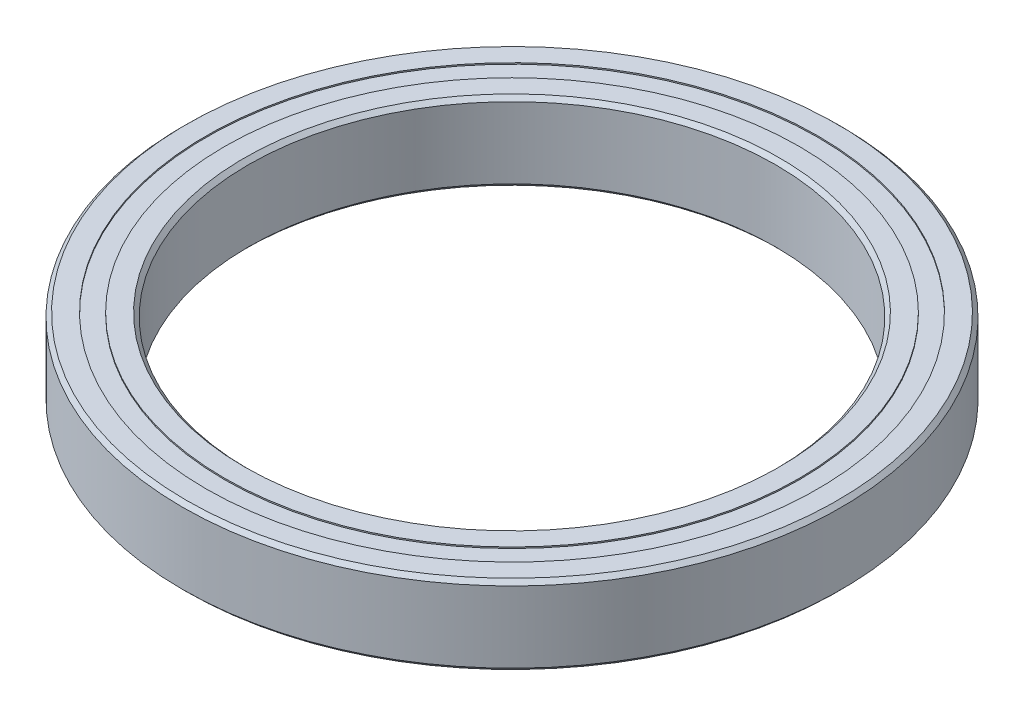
from build123d import *

# Parameters (mm, degrees)
SKETCH_1_R          = 25
SKETCH_1_R_2        = 20
EXTRUDE_1_DEPTH     = 6
CHAMFER_1_SIZE      = 0.3
SKETCH_2_R          = 23.2
SKETCH_2_R_2        = 21.8
CUT_EXTRUDE_1_DEPTH = 0.1
CUT_EXTRUDE_START   = -0.1
SKETCH_3_R          = 23.2
SKETCH_3_R_2        = 21.8
CUT_EXTRUDE_2_DEPTH = 0.1


with BuildPart() as part:
    # Sketch 1 → Extrude 1 (new body)
    with BuildSketch(Plane(origin=(0, 0, 0), x_dir=(1, 0, 0), z_dir=(0, 1, 0))):
        with Locations(Location((0, 0, 0), (0, 0, 270))):
            Circle(SKETCH_1_R)
        with Locations(Location((0, 0, 0), (0, 0, 270))):
            Circle(SKETCH_1_R_2, mode=Mode.SUBTRACT)
    extrude(amount=EXTRUDE_1_DEPTH)

    # Chamfer 1
    chamfer_1_edges = [part.edges().sort_by_distance(p)[0] for p in [
        (0, 0, -25),
        (0, 6, -25),
        (0, 0, -20),
        (0, 6, -20),
    ]]
    chamfer(chamfer_1_edges, length=CHAMFER_1_SIZE)

    # Sketch 2 → Cut-Extrude 1 (cut)
    with BuildSketch(Plane(origin=(0, 6, 0), x_dir=(1, 0, 0), z_dir=(0, 1, 0))):
        with Locations(Location((0, 0, 0), (0, 0, 270))):
            Circle(SKETCH_2_R)
        with Locations(Location((0, 0, 0), (0, 0, 270))):
            Circle(SKETCH_2_R_2, mode=Mode.SUBTRACT)
    extrude(amount=-CUT_EXTRUDE_1_DEPTH, mode=Mode.SUBTRACT)

    # Sketch 3 → Cut-Extrude 2 (cut)
    with BuildSketch(Plane.XZ.offset(CUT_EXTRUDE_START)):
        with Locations(Location((0, 0, 0), (0, 0, 90))):
            Circle(SKETCH_3_R)
        with Locations(Location((0, 0, 0), (0, 0, 90))):
            Circle(SKETCH_3_R_2, mode=Mode.SUBTRACT)
    extrude(amount=CUT_EXTRUDE_2_DEPTH, mode=Mode.SUBTRACT)


solid = part.part
